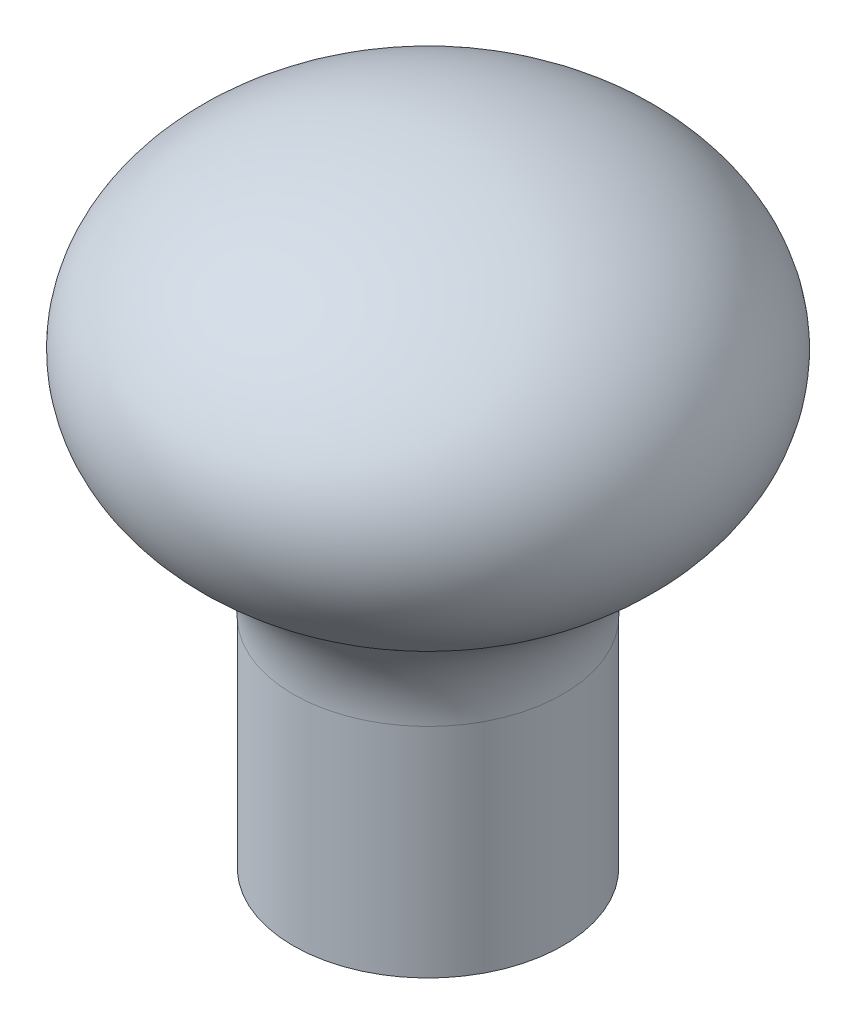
from build123d import *

# Parameters (mm, degrees)
FILLET1_R = 7


with BuildPart() as part:
    # Sketch1 → Revolve1 (revolve)
    with BuildSketch(Plane.XY, mode=Mode.PRIVATE) as revolve1_sk:
        with BuildLine():
            Line((7.5, 0), (7.5, 16.339745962))
            add(Edge.make_bspline(
                [(7.5, 16.339745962), (55.980762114, 35), (0, 35)],
                knots=[2.094395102, 2.094395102, 2.094395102, 4.71238898, 4.71238898, 4.71238898], degree=2, weights=[1, 0.258819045, 1]))
            Line((0, 35), (0, 0))
            Line((0, 0), (7.5, 0))
        make_face()
    revolve(revolve1_sk.sketch.rotate(Axis((0, 0, 0), (0, 1, 0)), 90), axis=Axis((0, 0, 0), (0, 1, 0)))

    # Fillet1
    fillet1_edges = [part.edges().sort_by_distance(p)[0] for p in [
        (0, 16.339745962, 7.5),
    ]]
    fillet(fillet1_edges, radius=FILLET1_R)


solid = part.part
